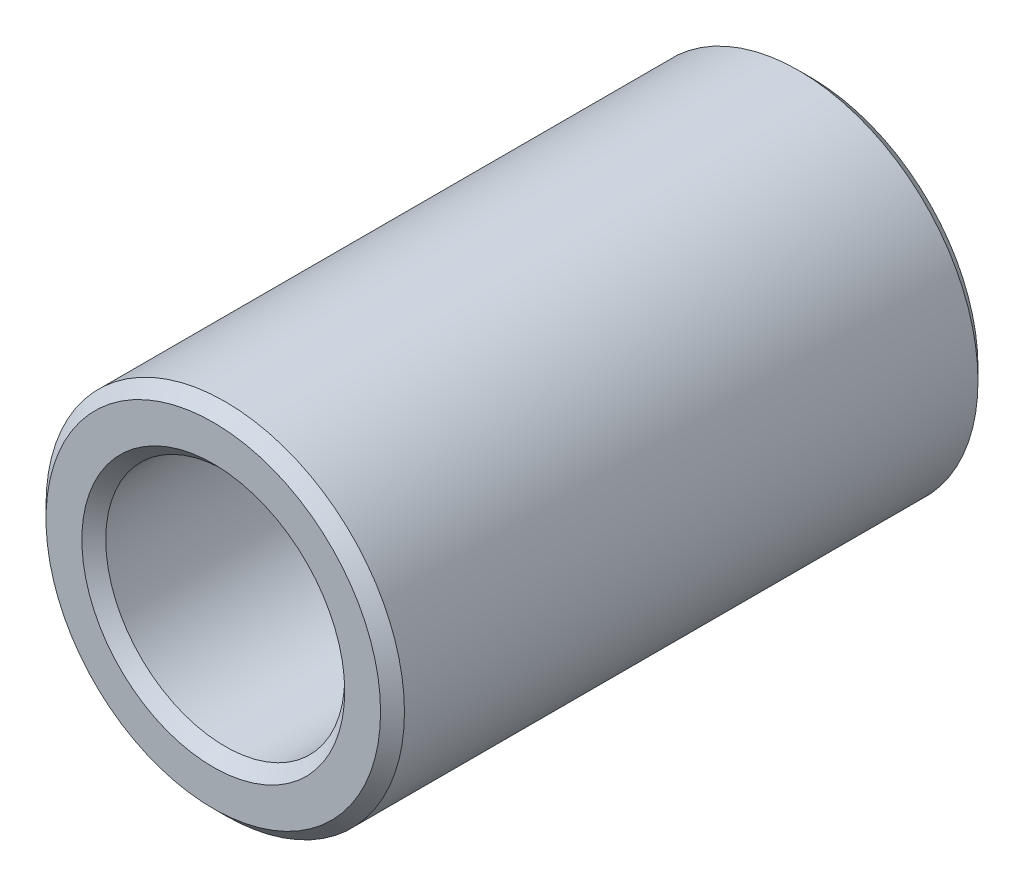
from build123d import *

# Parameters (mm, degrees)
ESQUISSE1_R          = 7.5
ESQUISSE1_R_2        = 5
BASE_EXTRUSION_DEPTH = 25
CHANFREIN1_SIZE      = 0.5


with BuildPart() as part:
    # Esquisse1 → Base-Extrusion (new body)
    with BuildSketch(Plane.XY):
        Circle(ESQUISSE1_R)
        Circle(ESQUISSE1_R_2, mode=Mode.SUBTRACT)
    extrude(amount=BASE_EXTRUSION_DEPTH)

    # Chanfrein1
    chanfrein1_edges = [part.edges().sort_by_distance(p)[0] for p in [
        (-7.5, 0, 0),
        (-7.5, 0, 25),
        (-5, 0, 0),
        (-5, 0, 25),
    ]]
    chamfer(chanfrein1_edges, length=CHANFREIN1_SIZE)


solid = part.part
